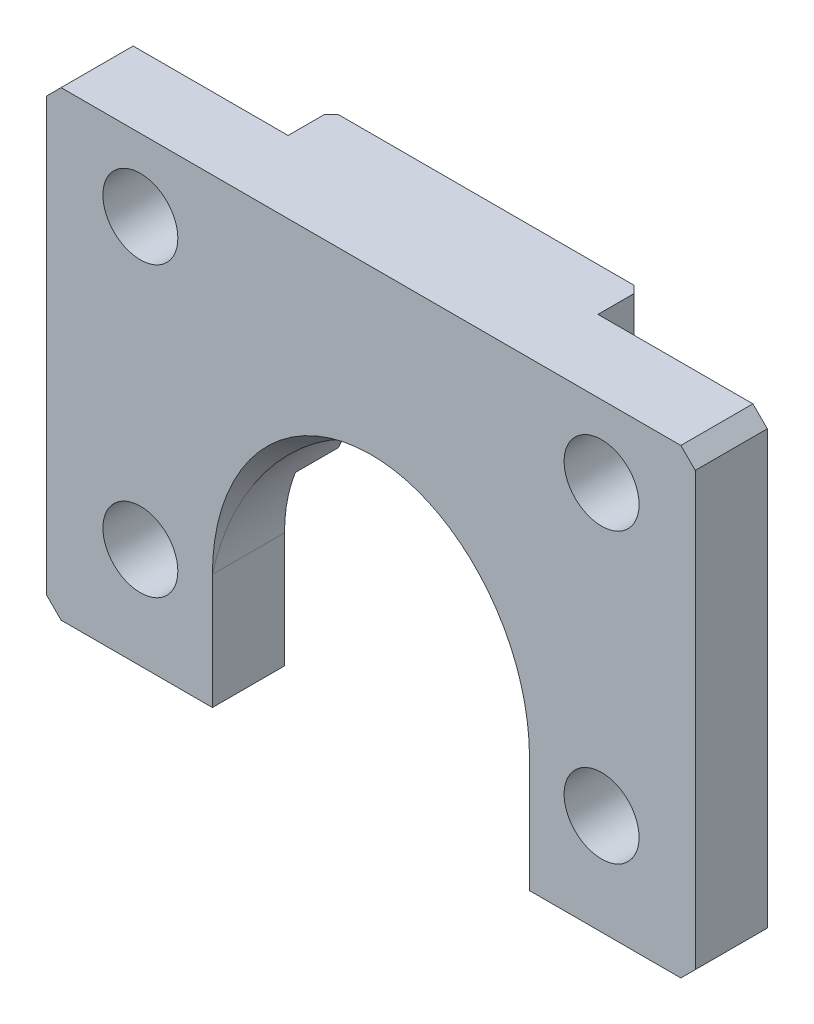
ISO-10303-21;
HEADER;
FILE_DESCRIPTION(('STEP AP214'),'2;1');
FILE_NAME('part.step','',(''),(''),'','','');
FILE_SCHEMA(('AUTOMOTIVE_DESIGN { 1 0 10303 214 1 1 1 1 }'));
ENDSEC;
DATA;
#1=APPLICATION_CONTEXT('core data for automotive mechanical design processes');
#2=APPLICATION_PROTOCOL_DEFINITION('international standard','automotive_design',2000,#1);
#3=PRODUCT_CONTEXT('',#1,'mechanical');
#4=PRODUCT('Part','Part','',(#3));
#5=PRODUCT_RELATED_PRODUCT_CATEGORY('part','',(#4));
#6=PRODUCT_DEFINITION_FORMATION('','',#4);
#7=PRODUCT_DEFINITION_CONTEXT('part definition',#1,'design');
#8=PRODUCT_DEFINITION('design','',#6,#7);
#9=PRODUCT_DEFINITION_SHAPE('','',#8);
#10=(LENGTH_UNIT() NAMED_UNIT(*) SI_UNIT(.MILLI.,.METRE.));
#11=(NAMED_UNIT(*) PLANE_ANGLE_UNIT() SI_UNIT($,.RADIAN.));
#12=(NAMED_UNIT(*) SI_UNIT($,.STERADIAN.) SOLID_ANGLE_UNIT());
#13=UNCERTAINTY_MEASURE_WITH_UNIT(LENGTH_MEASURE(1.E-05),#10,'distance_accuracy_value','');
#14=(GEOMETRIC_REPRESENTATION_CONTEXT(3) GLOBAL_UNCERTAINTY_ASSIGNED_CONTEXT((#13)) GLOBAL_UNIT_ASSIGNED_CONTEXT((#10,
#11,#12)) REPRESENTATION_CONTEXT('',''));
#15=CARTESIAN_POINT('',(0.,0.,0.));
#16=DIRECTION('',(0.,0.,1.));
#17=DIRECTION('',(1.,0.,0.));
#18=AXIS2_PLACEMENT_3D('',#15,#16,#17);
#19=CARTESIAN_POINT('',(-10.25,0.,-8.));
#20=DIRECTION('',(-0.707106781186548,0.,-0.707106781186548));
#21=DIRECTION('',(-0.707106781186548,0.,0.707106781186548));
#22=AXIS2_PLACEMENT_3D('',#19,#20,#21);
#23=PLANE('',#22);
#24=DIRECTION('',(-0.707106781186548,0.,0.707106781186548));
#25=VECTOR('',#24,1.);
#26=CARTESIAN_POINT('',(-10.25,0.,-8.));
#27=LINE('',#26,#25);
#28=CARTESIAN_POINT('',(-10.75,0.,-7.5));
#29=VERTEX_POINT('',#28);
#30=CARTESIAN_POINT('',(-10.25,0.,-8.));
#31=VERTEX_POINT('',#30);
#32=EDGE_CURVE('E229',#29,#31,#27,.F.);
#33=ORIENTED_EDGE('',*,*,#32,.T.);
#34=DIRECTION('',(0.,1.,0.));
#35=VECTOR('',#34,1.);
#36=CARTESIAN_POINT('',(-10.25,0.,-8.));
#37=LINE('',#36,#35);
#38=CARTESIAN_POINT('',(-10.2492074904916,-20.0027399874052,-8.00012340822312));
#39=VERTEX_POINT('',#38);
#40=EDGE_CURVE('E194',#39,#31,#37,.T.);
#41=ORIENTED_EDGE('',*,*,#40,.F.);
#42=DIRECTION('',(-0.707106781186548,0.,0.707106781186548));
#43=VECTOR('',#42,1.);
#44=CARTESIAN_POINT('',(-10.25,-20.,-8.));
#45=LINE('',#44,#43);
#46=CARTESIAN_POINT('',(-10.75,-20.,-7.5));
#47=VERTEX_POINT('',#46);
#48=EDGE_CURVE('E75',#39,#47,#45,.T.);
#49=ORIENTED_EDGE('',*,*,#48,.T.);
#50=DIRECTION('',(0.,1.,0.));
#51=VECTOR('',#50,1.);
#52=CARTESIAN_POINT('',(-10.75,0.,-7.5));
#53=LINE('',#52,#51);
#54=EDGE_CURVE('E113',#29,#47,#53,.F.);
#55=ORIENTED_EDGE('',*,*,#54,.F.);
#56=EDGE_LOOP('',(#33,#41,#49,#55));
#57=FACE_BOUND('',#56,.T.);
#58=ADVANCED_FACE('F16',(#57),#23,.T.);
#59=CARTESIAN_POINT('',(10.75,0.,-7.5));
#60=DIRECTION('',(0.707106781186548,0.,-0.707106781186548));
#61=DIRECTION('',(-0.707106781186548,0.,-0.707106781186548));
#62=AXIS2_PLACEMENT_3D('',#59,#60,#61);
#63=PLANE('',#62);
#64=DIRECTION('',(-0.707106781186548,0.,-0.707106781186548));
#65=VECTOR('',#64,1.);
#66=CARTESIAN_POINT('',(10.75,0.,-7.5));
#67=LINE('',#66,#65);
#68=CARTESIAN_POINT('',(10.25,0.,-8.));
#69=VERTEX_POINT('',#68);
#70=CARTESIAN_POINT('',(10.75,0.,-7.5));
#71=VERTEX_POINT('',#70);
#72=EDGE_CURVE('E91',#69,#71,#67,.F.);
#73=ORIENTED_EDGE('',*,*,#72,.T.);
#74=DIRECTION('',(0.,1.,0.));
#75=VECTOR('',#74,1.);
#76=CARTESIAN_POINT('',(10.75,0.,-7.5));
#77=LINE('',#76,#75);
#78=CARTESIAN_POINT('',(10.75,-20.,-7.5));
#79=VERTEX_POINT('',#78);
#80=EDGE_CURVE('E84',#79,#71,#77,.T.);
#81=ORIENTED_EDGE('',*,*,#80,.F.);
#82=DIRECTION('',(-0.707106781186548,0.,-0.707106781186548));
#83=VECTOR('',#82,1.);
#84=CARTESIAN_POINT('',(10.75,-20.,-7.5));
#85=LINE('',#84,#83);
#86=CARTESIAN_POINT('',(10.2492074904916,-20.0027399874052,-8.00012340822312));
#87=VERTEX_POINT('',#86);
#88=EDGE_CURVE('E88',#79,#87,#85,.T.);
#89=ORIENTED_EDGE('',*,*,#88,.T.);
#90=DIRECTION('',(0.,-1.,0.));
#91=VECTOR('',#90,1.);
#92=CARTESIAN_POINT('',(10.25,0.,-8.));
#93=LINE('',#92,#91);
#94=EDGE_CURVE('E191',#69,#87,#93,.T.);
#95=ORIENTED_EDGE('',*,*,#94,.F.);
#96=EDGE_LOOP('',(#73,#81,#89,#95));
#97=FACE_BOUND('',#96,.T.);
#98=ADVANCED_FACE('F86',(#97),#63,.T.);
#99=CARTESIAN_POINT('',(27.,-20.,-8.));
#100=DIRECTION('',(0.,1.,0.));
#101=DIRECTION('',(0.,0.,1.));
#102=AXIS2_PLACEMENT_3D('',#99,#100,#101);
#103=PLANE('',#102);
#104=DIRECTION('',(0.,0.,-1.));
#105=VECTOR('',#104,1.);
#106=CARTESIAN_POINT('',(10.75,-20.,-8.));
#107=LINE('',#106,#105);
#108=CARTESIAN_POINT('',(10.75,-20.,-5.));
#109=VERTEX_POINT('',#108);
#110=EDGE_CURVE('E96',#109,#79,#107,.T.);
#111=ORIENTED_EDGE('',*,*,#110,.F.);
#112=DIRECTION('',(1.,0.,0.));
#113=VECTOR('',#112,1.);
#114=CARTESIAN_POINT('',(27.,-20.,-5.));
#115=LINE('',#114,#113);
#116=CARTESIAN_POINT('',(10.2469507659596,-20.,-5.));
#117=VERTEX_POINT('',#116);
#118=EDGE_CURVE('E106',#117,#109,#115,.T.);
#119=ORIENTED_EDGE('',*,*,#118,.F.);
#120=DIRECTION('',(0.,0.,1.));
#121=VECTOR('',#120,1.);
#122=CARTESIAN_POINT('',(10.2469507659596,-20.,-5.));
#123=LINE('',#122,#121);
#124=EDGE_CURVE('E104',#117,#87,#123,.F.);
#125=ORIENTED_EDGE('',*,*,#124,.T.);
#126=ORIENTED_EDGE('',*,*,#88,.F.);
#127=EDGE_LOOP('',(#111,#119,#125,#126));
#128=FACE_BOUND('',#127,.T.);
#129=ADVANCED_FACE('F101',(#128),#103,.F.);
#130=CARTESIAN_POINT('',(27.,-20.,-8.));
#131=DIRECTION('',(0.,1.,0.));
#132=DIRECTION('',(0.,0.,1.));
#133=AXIS2_PLACEMENT_3D('',#130,#131,#132);
#134=PLANE('',#133);
#135=DIRECTION('',(0.,0.,1.));
#136=VECTOR('',#135,1.);
#137=CARTESIAN_POINT('',(-10.75,-20.,-5.));
#138=LINE('',#137,#136);
#139=CARTESIAN_POINT('',(-10.75,-20.,-5.));
#140=VERTEX_POINT('',#139);
#141=EDGE_CURVE('E199',#47,#140,#138,.T.);
#142=ORIENTED_EDGE('',*,*,#141,.F.);
#143=ORIENTED_EDGE('',*,*,#48,.F.);
#144=DIRECTION('',(0.,0.,1.));
#145=VECTOR('',#144,1.);
#146=CARTESIAN_POINT('',(-10.2469507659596,-20.,-8.00012340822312));
#147=LINE('',#146,#145);
#148=CARTESIAN_POINT('',(-10.2469507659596,-20.,-5.));
#149=VERTEX_POINT('',#148);
#150=EDGE_CURVE('E176',#39,#149,#147,.T.);
#151=ORIENTED_EDGE('',*,*,#150,.T.);
#152=DIRECTION('',(1.,0.,0.));
#153=VECTOR('',#152,1.);
#154=CARTESIAN_POINT('',(27.,-20.,-5.));
#155=LINE('',#154,#153);
#156=EDGE_CURVE('E203',#140,#149,#155,.T.);
#157=ORIENTED_EDGE('',*,*,#156,.F.);
#158=EDGE_LOOP('',(#142,#143,#151,#157));
#159=FACE_BOUND('',#158,.T.);
#160=ADVANCED_FACE('F311',(#159),#134,.F.);
#161=CARTESIAN_POINT('',(21.5,-32.,-5.));
#162=DIRECTION('',(-0.707106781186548,0.707106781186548,0.));
#163=DIRECTION('',(-0.707106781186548,-0.707106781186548,0.));
#164=AXIS2_PLACEMENT_3D('',#161,#162,#163);
#165=PLANE('',#164);
#166=DIRECTION('',(0.,0.,-1.));
#167=VECTOR('',#166,1.);
#168=CARTESIAN_POINT('',(22.5,-31.,-5.));
#169=LINE('',#168,#167);
#170=CARTESIAN_POINT('',(22.5,-31.,0.));
#171=VERTEX_POINT('',#170);
#172=CARTESIAN_POINT('',(22.5,-31.,-5.));
#173=VERTEX_POINT('',#172);
#174=EDGE_CURVE('E360',#171,#173,#169,.T.);
#175=ORIENTED_EDGE('',*,*,#174,.F.);
#176=DIRECTION('',(-0.707106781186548,-0.707106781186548,0.));
#177=VECTOR('',#176,1.);
#178=CARTESIAN_POINT('',(21.5,-32.,0.));
#179=LINE('',#178,#177);
#180=CARTESIAN_POINT('',(21.5,-32.,0.));
#181=VERTEX_POINT('',#180);
#182=EDGE_CURVE('E97',#181,#171,#179,.F.);
#183=ORIENTED_EDGE('',*,*,#182,.F.);
#184=DIRECTION('',(0.,0.,-1.));
#185=VECTOR('',#184,1.);
#186=CARTESIAN_POINT('',(21.5,-32.,0.));
#187=LINE('',#186,#185);
#188=CARTESIAN_POINT('',(21.5,-32.,-5.));
#189=VERTEX_POINT('',#188);
#190=EDGE_CURVE('E346',#189,#181,#187,.F.);
#191=ORIENTED_EDGE('',*,*,#190,.F.);
#192=DIRECTION('',(-0.707106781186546,-0.707106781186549,0.));
#193=VECTOR('',#192,1.);
#194=CARTESIAN_POINT('',(22.5,-31.,-5.));
#195=LINE('',#194,#193);
#196=EDGE_CURVE('E172',#173,#189,#195,.T.);
#197=ORIENTED_EDGE('',*,*,#196,.F.);
#198=EDGE_LOOP('',(#175,#183,#191,#197));
#199=FACE_BOUND('',#198,.T.);
#200=ADVANCED_FACE('F433',(#199),#165,.F.);
#201=CARTESIAN_POINT('',(10.75,0.,-8.));
#202=DIRECTION('',(1.,0.,0.));
#203=DIRECTION('',(0.,0.,-1.));
#204=AXIS2_PLACEMENT_3D('',#201,#202,#203);
#205=PLANE('',#204);
#206=DIRECTION('',(0.,1.,0.));
#207=VECTOR('',#206,1.);
#208=CARTESIAN_POINT('',(10.75,0.,-5.));
#209=LINE('',#208,#207);
#210=CARTESIAN_POINT('',(10.75,0.,-5.));
#211=VERTEX_POINT('',#210);
#212=EDGE_CURVE('E109',#109,#211,#209,.T.);
#213=ORIENTED_EDGE('',*,*,#212,.F.);
#214=ORIENTED_EDGE('',*,*,#110,.T.);
#215=ORIENTED_EDGE('',*,*,#80,.T.);
#216=DIRECTION('',(0.,0.,-1.));
#217=VECTOR('',#216,1.);
#218=CARTESIAN_POINT('',(10.75,0.,0.));
#219=LINE('',#218,#217);
#220=EDGE_CURVE('E125',#71,#211,#219,.F.);
#221=ORIENTED_EDGE('',*,*,#220,.T.);
#222=EDGE_LOOP('',(#213,#214,#215,#221));
#223=FACE_BOUND('',#222,.T.);
#224=ADVANCED_FACE('F107',(#223),#205,.T.);
#225=CARTESIAN_POINT('',(21.5,0.,-5.));
#226=DIRECTION('',(0.707106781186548,0.707106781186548,0.));
#227=DIRECTION('',(-0.707106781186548,0.707106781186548,0.));
#228=AXIS2_PLACEMENT_3D('',#225,#226,#227);
#229=PLANE('',#228);
#230=DIRECTION('',(0.707106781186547,-0.707106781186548,0.));
#231=VECTOR('',#230,1.);
#232=CARTESIAN_POINT('',(21.5,0.,-5.));
#233=LINE('',#232,#231);
#234=CARTESIAN_POINT('',(21.5,0.,-5.));
#235=VERTEX_POINT('',#234);
#236=CARTESIAN_POINT('',(22.5,-1.,-5.));
#237=VERTEX_POINT('',#236);
#238=EDGE_CURVE('E121',#235,#237,#233,.T.);
#239=ORIENTED_EDGE('',*,*,#238,.F.);
#240=DIRECTION('',(0.,0.,-1.));
#241=VECTOR('',#240,1.);
#242=CARTESIAN_POINT('',(21.5,0.,0.));
#243=LINE('',#242,#241);
#244=CARTESIAN_POINT('',(21.5,0.,0.));
#245=VERTEX_POINT('',#244);
#246=EDGE_CURVE('E405',#235,#245,#243,.F.);
#247=ORIENTED_EDGE('',*,*,#246,.T.);
#248=DIRECTION('',(-0.707106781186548,0.707106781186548,0.));
#249=VECTOR('',#248,1.);
#250=CARTESIAN_POINT('',(21.5,0.,0.));
#251=LINE('',#250,#249);
#252=CARTESIAN_POINT('',(22.5,-0.999999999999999,0.));
#253=VERTEX_POINT('',#252);
#254=EDGE_CURVE('E110',#245,#253,#251,.F.);
#255=ORIENTED_EDGE('',*,*,#254,.T.);
#256=DIRECTION('',(0.,0.,-1.));
#257=VECTOR('',#256,1.);
#258=CARTESIAN_POINT('',(22.5,-1.,-5.));
#259=LINE('',#258,#257);
#260=EDGE_CURVE('E128',#237,#253,#259,.F.);
#261=ORIENTED_EDGE('',*,*,#260,.F.);
#262=EDGE_LOOP('',(#239,#247,#255,#261));
#263=FACE_BOUND('',#262,.T.);
#264=ADVANCED_FACE('F469',(#263),#229,.T.);
#265=CARTESIAN_POINT('',(-10.75,0.,-5.));
#266=DIRECTION('',(-1.,0.,0.));
#267=DIRECTION('',(0.,0.,1.));
#268=AXIS2_PLACEMENT_3D('',#265,#266,#267);
#269=PLANE('',#268);
#270=ORIENTED_EDGE('',*,*,#54,.T.);
#271=ORIENTED_EDGE('',*,*,#141,.T.);
#272=DIRECTION('',(0.,1.,0.));
#273=VECTOR('',#272,1.);
#274=CARTESIAN_POINT('',(-10.75,0.,-5.));
#275=LINE('',#274,#273);
#276=CARTESIAN_POINT('',(-10.75,0.,-5.));
#277=VERTEX_POINT('',#276);
#278=EDGE_CURVE('E175',#277,#140,#275,.F.);
#279=ORIENTED_EDGE('',*,*,#278,.F.);
#280=DIRECTION('',(0.,0.,-1.));
#281=VECTOR('',#280,1.);
#282=CARTESIAN_POINT('',(-10.75,0.,0.));
#283=LINE('',#282,#281);
#284=EDGE_CURVE('E131',#277,#29,#283,.T.);
#285=ORIENTED_EDGE('',*,*,#284,.T.);
#286=EDGE_LOOP('',(#270,#271,#279,#285));
#287=FACE_BOUND('',#286,.T.);
#288=ADVANCED_FACE('F250',(#287),#269,.T.);
#289=CARTESIAN_POINT('',(-10.75,0.,-8.));
#290=DIRECTION('',(0.,0.,-1.));
#291=DIRECTION('',(-1.,0.,0.));
#292=AXIS2_PLACEMENT_3D('',#289,#290,#291);
#293=PLANE('',#292);
#294=ORIENTED_EDGE('',*,*,#94,.T.);
#295=CARTESIAN_POINT('',(0.,-24.,-8.));
#296=DIRECTION('',(0.,0.,1.));
#297=DIRECTION('',(1.,0.,0.));
#298=AXIS2_PLACEMENT_3D('',#295,#296,#297);
#299=CIRCLE('',#298,11.);
#300=EDGE_CURVE('E180',#87,#39,#299,.T.);
#301=ORIENTED_EDGE('',*,*,#300,.T.);
#302=ORIENTED_EDGE('',*,*,#40,.T.);
#303=DIRECTION('',(1.,0.,0.));
#304=VECTOR('',#303,1.);
#305=CARTESIAN_POINT('',(0.,0.,-8.));
#306=LINE('',#305,#304);
#307=EDGE_CURVE('E134',#31,#69,#306,.T.);
#308=ORIENTED_EDGE('',*,*,#307,.T.);
#309=EDGE_LOOP('',(#294,#301,#302,#308));
#310=FACE_BOUND('',#309,.T.);
#311=ADVANCED_FACE('F309',(#310),#293,.T.);
#312=CARTESIAN_POINT('',(-21.5,0.,0.));
#313=DIRECTION('',(-0.707106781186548,0.707106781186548,0.));
#314=DIRECTION('',(-0.707106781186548,-0.707106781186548,0.));
#315=AXIS2_PLACEMENT_3D('',#312,#313,#314);
#316=PLANE('',#315);
#317=DIRECTION('',(-0.707106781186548,-0.707106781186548,0.));
#318=VECTOR('',#317,1.);
#319=CARTESIAN_POINT('',(-21.5,0.,0.));
#320=LINE('',#319,#318);
#321=CARTESIAN_POINT('',(-22.5,-0.999999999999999,0.));
#322=VERTEX_POINT('',#321);
#323=CARTESIAN_POINT('',(-21.5,0.,0.));
#324=VERTEX_POINT('',#323);
#325=EDGE_CURVE('E193',#322,#324,#320,.F.);
#326=ORIENTED_EDGE('',*,*,#325,.T.);
#327=DIRECTION('',(0.,0.,-1.));
#328=VECTOR('',#327,1.);
#329=CARTESIAN_POINT('',(-21.5,0.,0.));
#330=LINE('',#329,#328);
#331=CARTESIAN_POINT('',(-21.5,0.,-5.));
#332=VERTEX_POINT('',#331);
#333=EDGE_CURVE('E386',#324,#332,#330,.T.);
#334=ORIENTED_EDGE('',*,*,#333,.T.);
#335=DIRECTION('',(0.707106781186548,0.707106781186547,0.));
#336=VECTOR('',#335,1.);
#337=CARTESIAN_POINT('',(-22.5,-1.,-5.));
#338=LINE('',#337,#336);
#339=CARTESIAN_POINT('',(-22.5,-1.,-5.));
#340=VERTEX_POINT('',#339);
#341=EDGE_CURVE('E243',#340,#332,#338,.T.);
#342=ORIENTED_EDGE('',*,*,#341,.F.);
#343=DIRECTION('',(0.,0.,1.));
#344=VECTOR('',#343,1.);
#345=CARTESIAN_POINT('',(-22.5,-1.,0.));
#346=LINE('',#345,#344);
#347=EDGE_CURVE('E370',#322,#340,#346,.F.);
#348=ORIENTED_EDGE('',*,*,#347,.F.);
#349=EDGE_LOOP('',(#326,#334,#342,#348));
#350=FACE_BOUND('',#349,.T.);
#351=ADVANCED_FACE('F384',(#350),#316,.T.);
#352=CARTESIAN_POINT('',(-21.5,-32.,0.));
#353=DIRECTION('',(0.707106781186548,0.707106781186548,0.));
#354=DIRECTION('',(-0.707106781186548,0.707106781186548,0.));
#355=AXIS2_PLACEMENT_3D('',#352,#353,#354);
#356=PLANE('',#355);
#357=DIRECTION('',(0.,0.,1.));
#358=VECTOR('',#357,1.);
#359=CARTESIAN_POINT('',(-22.5,-31.,0.));
#360=LINE('',#359,#358);
#361=CARTESIAN_POINT('',(-22.5,-31.,-5.));
#362=VERTEX_POINT('',#361);
#363=CARTESIAN_POINT('',(-22.5,-31.,0.));
#364=VERTEX_POINT('',#363);
#365=EDGE_CURVE('E367',#362,#364,#360,.T.);
#366=ORIENTED_EDGE('',*,*,#365,.F.);
#367=DIRECTION('',(-0.707106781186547,0.707106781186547,0.));
#368=VECTOR('',#367,1.);
#369=CARTESIAN_POINT('',(-21.5,-32.,-5.));
#370=LINE('',#369,#368);
#371=CARTESIAN_POINT('',(-21.5,-32.,-5.));
#372=VERTEX_POINT('',#371);
#373=EDGE_CURVE('E179',#372,#362,#370,.T.);
#374=ORIENTED_EDGE('',*,*,#373,.F.);
#375=DIRECTION('',(0.,0.,-1.));
#376=VECTOR('',#375,1.);
#377=CARTESIAN_POINT('',(-21.5,-32.,0.));
#378=LINE('',#377,#376);
#379=CARTESIAN_POINT('',(-21.5,-32.,0.));
#380=VERTEX_POINT('',#379);
#381=EDGE_CURVE('E390',#380,#372,#378,.T.);
#382=ORIENTED_EDGE('',*,*,#381,.F.);
#383=DIRECTION('',(-0.707106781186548,0.707106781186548,0.));
#384=VECTOR('',#383,1.);
#385=CARTESIAN_POINT('',(-21.5,-32.,0.));
#386=LINE('',#385,#384);
#387=EDGE_CURVE('E188',#364,#380,#386,.F.);
#388=ORIENTED_EDGE('',*,*,#387,.F.);
#389=EDGE_LOOP('',(#366,#374,#382,#388));
#390=FACE_BOUND('',#389,.T.);
#391=ADVANCED_FACE('F529',(#390),#356,.F.);
#392=CARTESIAN_POINT('',(0.,-24.,0.));
#393=DIRECTION('',(0.,0.,1.));
#394=DIRECTION('',(1.,0.,0.));
#395=AXIS2_PLACEMENT_3D('',#392,#393,#394);
#396=CYLINDRICAL_SURFACE('',#395,11.);
#397=CARTESIAN_POINT('',(0.,-24.,-5.));
#398=DIRECTION('',(0.,0.,1.));
#399=DIRECTION('',(1.,0.,0.));
#400=AXIS2_PLACEMENT_3D('',#397,#398,#399);
#401=CIRCLE('',#400,11.);
#402=CARTESIAN_POINT('',(-11.,-24.,-5.));
#403=VERTEX_POINT('',#402);
#404=EDGE_CURVE('E122',#149,#403,#401,.T.);
#405=ORIENTED_EDGE('',*,*,#404,.F.);
#406=ORIENTED_EDGE('',*,*,#150,.F.);
#407=ORIENTED_EDGE('',*,*,#300,.F.);
#408=ORIENTED_EDGE('',*,*,#124,.F.);
#409=CARTESIAN_POINT('',(0.,-24.,-5.));
#410=DIRECTION('',(0.,0.,1.));
#411=DIRECTION('',(1.,0.,0.));
#412=AXIS2_PLACEMENT_3D('',#409,#410,#411);
#413=CIRCLE('',#412,11.);
#414=CARTESIAN_POINT('',(11.,-24.,-5.));
#415=VERTEX_POINT('',#414);
#416=EDGE_CURVE('E169',#415,#117,#413,.T.);
#417=ORIENTED_EDGE('',*,*,#416,.F.);
#418=DIRECTION('',(0.,0.,-1.));
#419=VECTOR('',#418,1.);
#420=CARTESIAN_POINT('',(11.,-24.,0.));
#421=LINE('',#420,#419);
#422=CARTESIAN_POINT('',(11.,-24.0000000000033,0.));
#423=VERTEX_POINT('',#422);
#424=EDGE_CURVE('E165',#415,#423,#421,.F.);
#425=ORIENTED_EDGE('',*,*,#424,.T.);
#426=CARTESIAN_POINT('',(0.,-24.,-2.06779038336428E-12));
#427=DIRECTION('',(0.,0.25881904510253,0.965925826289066));
#428=DIRECTION('',(0.,-0.965925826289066,0.25881904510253));
#429=AXIS2_PLACEMENT_3D('',#426,#427,#428);
#430=ELLIPSE('',#429,11.3880379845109,11.);
#431=CARTESIAN_POINT('',(-11.,-24.0000000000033,0.));
#432=VERTEX_POINT('',#431);
#433=EDGE_CURVE('E34',#423,#432,#430,.T.);
#434=ORIENTED_EDGE('',*,*,#433,.T.);
#435=DIRECTION('',(0.,0.,1.));
#436=VECTOR('',#435,1.);
#437=CARTESIAN_POINT('',(-11.,-24.,0.));
#438=LINE('',#437,#436);
#439=EDGE_CURVE('E312',#432,#403,#438,.F.);
#440=ORIENTED_EDGE('',*,*,#439,.T.);
#441=EDGE_LOOP('',(#405,#406,#407,#408,#417,#425,#434,#440));
#442=FACE_BOUND('',#441,.T.);
#443=ADVANCED_FACE('F306',(#442),#396,.F.);
#444=CARTESIAN_POINT('',(10.75,0.,-5.));
#445=DIRECTION('',(0.,0.,-1.));
#446=DIRECTION('',(-1.,0.,0.));
#447=AXIS2_PLACEMENT_3D('',#444,#445,#446);
#448=PLANE('',#447);
#449=CARTESIAN_POINT('',(-16.,-25.,-5.));
#450=DIRECTION('',(0.,0.,1.));
#451=DIRECTION('',(1.,0.,0.));
#452=AXIS2_PLACEMENT_3D('',#449,#450,#451);
#453=CIRCLE('',#452,2.6);
#454=CARTESIAN_POINT('',(-13.4,-25.,-5.));
#455=VERTEX_POINT('',#454);
#456=EDGE_CURVE('E157',#455,#455,#453,.T.);
#457=ORIENTED_EDGE('',*,*,#456,.T.);
#458=EDGE_LOOP('',(#457));
#459=FACE_BOUND('',#458,.T.);
#460=CARTESIAN_POINT('',(-16.,-5.,-5.));
#461=DIRECTION('',(0.,0.,1.));
#462=DIRECTION('',(1.,0.,0.));
#463=AXIS2_PLACEMENT_3D('',#460,#461,#462);
#464=CIRCLE('',#463,2.6);
#465=CARTESIAN_POINT('',(-13.4,-5.,-5.));
#466=VERTEX_POINT('',#465);
#467=EDGE_CURVE('E160',#466,#466,#464,.T.);
#468=ORIENTED_EDGE('',*,*,#467,.T.);
#469=EDGE_LOOP('',(#468));
#470=FACE_BOUND('',#469,.T.);
#471=ORIENTED_EDGE('',*,*,#156,.T.);
#472=ORIENTED_EDGE('',*,*,#404,.T.);
#473=DIRECTION('',(0.,1.,0.));
#474=VECTOR('',#473,1.);
#475=CARTESIAN_POINT('',(-11.,-24.,-5.));
#476=LINE('',#475,#474);
#477=CARTESIAN_POINT('',(-11.,-32.,-5.));
#478=VERTEX_POINT('',#477);
#479=EDGE_CURVE('E316',#403,#478,#476,.F.);
#480=ORIENTED_EDGE('',*,*,#479,.T.);
#481=DIRECTION('',(1.,0.,0.));
#482=VECTOR('',#481,1.);
#483=CARTESIAN_POINT('',(0.,-32.,-5.));
#484=LINE('',#483,#482);
#485=EDGE_CURVE('E325',#372,#478,#484,.T.);
#486=ORIENTED_EDGE('',*,*,#485,.F.);
#487=ORIENTED_EDGE('',*,*,#373,.T.);
#488=DIRECTION('',(0.,1.,0.));
#489=VECTOR('',#488,1.);
#490=CARTESIAN_POINT('',(-22.5,0.,-5.));
#491=LINE('',#490,#489);
#492=EDGE_CURVE('E234',#340,#362,#491,.F.);
#493=ORIENTED_EDGE('',*,*,#492,.F.);
#494=ORIENTED_EDGE('',*,*,#341,.T.);
#495=DIRECTION('',(1.,0.,0.));
#496=VECTOR('',#495,1.);
#497=CARTESIAN_POINT('',(0.,0.,-5.));
#498=LINE('',#497,#496);
#499=EDGE_CURVE('E135',#332,#277,#498,.T.);
#500=ORIENTED_EDGE('',*,*,#499,.T.);
#501=ORIENTED_EDGE('',*,*,#278,.T.);
#502=EDGE_LOOP('',(#471,#472,#480,#486,#487,#493,#494,#500,#501));
#503=FACE_BOUND('',#502,.T.);
#504=ADVANCED_FACE('F314',(#459,#470,#503),#448,.T.);
#505=CARTESIAN_POINT('',(10.75,0.,-5.));
#506=DIRECTION('',(0.,0.,-1.));
#507=DIRECTION('',(-1.,0.,0.));
#508=AXIS2_PLACEMENT_3D('',#505,#506,#507);
#509=PLANE('',#508);
#510=CARTESIAN_POINT('',(16.,-25.,-5.));
#511=DIRECTION('',(0.,0.,1.));
#512=DIRECTION('',(1.,0.,0.));
#513=AXIS2_PLACEMENT_3D('',#510,#511,#512);
#514=CIRCLE('',#513,2.6);
#515=CARTESIAN_POINT('',(18.6,-25.,-5.));
#516=VERTEX_POINT('',#515);
#517=EDGE_CURVE('E150',#516,#516,#514,.T.);
#518=ORIENTED_EDGE('',*,*,#517,.T.);
#519=EDGE_LOOP('',(#518));
#520=FACE_BOUND('',#519,.T.);
#521=CARTESIAN_POINT('',(16.,-5.,-5.));
#522=DIRECTION('',(0.,0.,1.));
#523=DIRECTION('',(1.,0.,0.));
#524=AXIS2_PLACEMENT_3D('',#521,#522,#523);
#525=CIRCLE('',#524,2.6);
#526=CARTESIAN_POINT('',(18.6,-5.,-5.));
#527=VERTEX_POINT('',#526);
#528=EDGE_CURVE('E154',#527,#527,#525,.T.);
#529=ORIENTED_EDGE('',*,*,#528,.T.);
#530=EDGE_LOOP('',(#529));
#531=FACE_BOUND('',#530,.T.);
#532=DIRECTION('',(0.,1.,0.));
#533=VECTOR('',#532,1.);
#534=CARTESIAN_POINT('',(11.,-32.,-5.));
#535=LINE('',#534,#533);
#536=CARTESIAN_POINT('',(11.,-32.,-5.));
#537=VERTEX_POINT('',#536);
#538=EDGE_CURVE('E168',#537,#415,#535,.T.);
#539=ORIENTED_EDGE('',*,*,#538,.T.);
#540=ORIENTED_EDGE('',*,*,#416,.T.);
#541=ORIENTED_EDGE('',*,*,#118,.T.);
#542=ORIENTED_EDGE('',*,*,#212,.T.);
#543=DIRECTION('',(1.,0.,0.));
#544=VECTOR('',#543,1.);
#545=CARTESIAN_POINT('',(0.,0.,-5.));
#546=LINE('',#545,#544);
#547=EDGE_CURVE('E127',#211,#235,#546,.T.);
#548=ORIENTED_EDGE('',*,*,#547,.T.);
#549=ORIENTED_EDGE('',*,*,#238,.T.);
#550=DIRECTION('',(0.,1.,0.));
#551=VECTOR('',#550,1.);
#552=CARTESIAN_POINT('',(22.5,0.,-5.));
#553=LINE('',#552,#551);
#554=EDGE_CURVE('E357',#173,#237,#553,.T.);
#555=ORIENTED_EDGE('',*,*,#554,.F.);
#556=ORIENTED_EDGE('',*,*,#196,.T.);
#557=DIRECTION('',(1.,0.,0.));
#558=VECTOR('',#557,1.);
#559=CARTESIAN_POINT('',(0.,-32.,-5.));
#560=LINE('',#559,#558);
#561=EDGE_CURVE('E167',#537,#189,#560,.T.);
#562=ORIENTED_EDGE('',*,*,#561,.F.);
#563=EDGE_LOOP('',(#539,#540,#541,#542,#548,#549,#555,#556,#562));
#564=FACE_BOUND('',#563,.T.);
#565=ADVANCED_FACE('F301',(#520,#531,#564),#509,.T.);
#566=CARTESIAN_POINT('',(11.,-32.,0.));
#567=DIRECTION('',(1.,0.,0.));
#568=DIRECTION('',(0.,0.,-1.));
#569=AXIS2_PLACEMENT_3D('',#566,#567,#568);
#570=PLANE('',#569);
#571=ORIENTED_EDGE('',*,*,#538,.F.);
#572=DIRECTION('',(0.,0.,-1.));
#573=VECTOR('',#572,1.);
#574=CARTESIAN_POINT('',(11.,-32.,0.));
#575=LINE('',#574,#573);
#576=CARTESIAN_POINT('',(11.,-32.,0.));
#577=VERTEX_POINT('',#576);
#578=EDGE_CURVE('E354',#577,#537,#575,.T.);
#579=ORIENTED_EDGE('',*,*,#578,.F.);
#580=DIRECTION('',(0.,1.,0.));
#581=VECTOR('',#580,1.);
#582=CARTESIAN_POINT('',(11.,0.,0.));
#583=LINE('',#582,#581);
#584=EDGE_CURVE('E153',#423,#577,#583,.F.);
#585=ORIENTED_EDGE('',*,*,#584,.F.);
#586=ORIENTED_EDGE('',*,*,#424,.F.);
#587=EDGE_LOOP('',(#571,#579,#585,#586));
#588=FACE_BOUND('',#587,.T.);
#589=ADVANCED_FACE('F426',(#588),#570,.F.);
#590=CARTESIAN_POINT('',(0.,-32.,0.));
#591=DIRECTION('',(0.,-1.,0.));
#592=DIRECTION('',(0.,0.,-1.));
#593=AXIS2_PLACEMENT_3D('',#590,#591,#592);
#594=PLANE('',#593);
#595=DIRECTION('',(1.,0.,0.));
#596=VECTOR('',#595,1.);
#597=CARTESIAN_POINT('',(22.5,-32.,0.));
#598=LINE('',#597,#596);
#599=EDGE_CURVE('E411',#577,#181,#598,.T.);
#600=ORIENTED_EDGE('',*,*,#599,.F.);
#601=ORIENTED_EDGE('',*,*,#578,.T.);
#602=ORIENTED_EDGE('',*,*,#561,.T.);
#603=ORIENTED_EDGE('',*,*,#190,.T.);
#604=EDGE_LOOP('',(#600,#601,#602,#603));
#605=FACE_BOUND('',#604,.T.);
#606=ADVANCED_FACE('F421',(#605),#594,.T.);
#607=CARTESIAN_POINT('',(22.5,0.,-5.));
#608=DIRECTION('',(1.,0.,0.));
#609=DIRECTION('',(0.,0.,-1.));
#610=AXIS2_PLACEMENT_3D('',#607,#608,#609);
#611=PLANE('',#610);
#612=ORIENTED_EDGE('',*,*,#554,.T.);
#613=ORIENTED_EDGE('',*,*,#260,.T.);
#614=DIRECTION('',(0.,1.,0.));
#615=VECTOR('',#614,1.);
#616=CARTESIAN_POINT('',(22.5,0.,0.));
#617=LINE('',#616,#615);
#618=EDGE_CURVE('E414',#171,#253,#617,.T.);
#619=ORIENTED_EDGE('',*,*,#618,.F.);
#620=ORIENTED_EDGE('',*,*,#174,.T.);
#621=EDGE_LOOP('',(#612,#613,#619,#620));
#622=FACE_BOUND('',#621,.T.);
#623=ADVANCED_FACE('F460',(#622),#611,.T.);
#624=CARTESIAN_POINT('',(0.,0.,0.));
#625=DIRECTION('',(0.,-1.,0.));
#626=DIRECTION('',(0.,0.,-1.));
#627=AXIS2_PLACEMENT_3D('',#624,#625,#626);
#628=PLANE('',#627);
#629=ORIENTED_EDGE('',*,*,#307,.F.);
#630=ORIENTED_EDGE('',*,*,#32,.F.);
#631=ORIENTED_EDGE('',*,*,#284,.F.);
#632=ORIENTED_EDGE('',*,*,#499,.F.);
#633=ORIENTED_EDGE('',*,*,#333,.F.);
#634=DIRECTION('',(1.,0.,0.));
#635=VECTOR('',#634,1.);
#636=CARTESIAN_POINT('',(22.5,0.,0.));
#637=LINE('',#636,#635);
#638=EDGE_CURVE('E225',#245,#324,#637,.F.);
#639=ORIENTED_EDGE('',*,*,#638,.F.);
#640=ORIENTED_EDGE('',*,*,#246,.F.);
#641=ORIENTED_EDGE('',*,*,#547,.F.);
#642=ORIENTED_EDGE('',*,*,#220,.F.);
#643=ORIENTED_EDGE('',*,*,#72,.F.);
#644=EDGE_LOOP('',(#629,#630,#631,#632,#633,#639,#640,#641,#642,#643));
#645=FACE_BOUND('',#644,.T.);
#646=ADVANCED_FACE('F466',(#645),#628,.F.);
#647=CARTESIAN_POINT('',(-22.5,0.,0.));
#648=DIRECTION('',(-1.,0.,0.));
#649=DIRECTION('',(0.,0.,1.));
#650=AXIS2_PLACEMENT_3D('',#647,#648,#649);
#651=PLANE('',#650);
#652=DIRECTION('',(0.,1.,0.));
#653=VECTOR('',#652,1.);
#654=CARTESIAN_POINT('',(-22.5,0.,0.));
#655=LINE('',#654,#653);
#656=EDGE_CURVE('E221',#322,#364,#655,.F.);
#657=ORIENTED_EDGE('',*,*,#656,.F.);
#658=ORIENTED_EDGE('',*,*,#347,.T.);
#659=ORIENTED_EDGE('',*,*,#492,.T.);
#660=ORIENTED_EDGE('',*,*,#365,.T.);
#661=EDGE_LOOP('',(#657,#658,#659,#660));
#662=FACE_BOUND('',#661,.T.);
#663=ADVANCED_FACE('F377',(#662),#651,.T.);
#664=CARTESIAN_POINT('',(0.,-32.,0.));
#665=DIRECTION('',(0.,-1.,0.));
#666=DIRECTION('',(0.,0.,-1.));
#667=AXIS2_PLACEMENT_3D('',#664,#665,#666);
#668=PLANE('',#667);
#669=ORIENTED_EDGE('',*,*,#485,.T.);
#670=DIRECTION('',(0.,0.,1.));
#671=VECTOR('',#670,1.);
#672=CARTESIAN_POINT('',(-11.,-32.,0.));
#673=LINE('',#672,#671);
#674=CARTESIAN_POINT('',(-11.,-32.,0.));
#675=VERTEX_POINT('',#674);
#676=EDGE_CURVE('E164',#478,#675,#673,.T.);
#677=ORIENTED_EDGE('',*,*,#676,.T.);
#678=DIRECTION('',(1.,0.,0.));
#679=VECTOR('',#678,1.);
#680=CARTESIAN_POINT('',(22.5,-32.,0.));
#681=LINE('',#680,#679);
#682=EDGE_CURVE('E224',#380,#675,#681,.T.);
#683=ORIENTED_EDGE('',*,*,#682,.F.);
#684=ORIENTED_EDGE('',*,*,#381,.T.);
#685=EDGE_LOOP('',(#669,#677,#683,#684));
#686=FACE_BOUND('',#685,.T.);
#687=ADVANCED_FACE('F508',(#686),#668,.T.);
#688=CARTESIAN_POINT('',(-11.,-24.,0.));
#689=DIRECTION('',(-1.,0.,0.));
#690=DIRECTION('',(0.,0.,1.));
#691=AXIS2_PLACEMENT_3D('',#688,#689,#690);
#692=PLANE('',#691);
#693=ORIENTED_EDGE('',*,*,#479,.F.);
#694=ORIENTED_EDGE('',*,*,#439,.F.);
#695=DIRECTION('',(0.,1.,0.));
#696=VECTOR('',#695,1.);
#697=CARTESIAN_POINT('',(-11.,0.,0.));
#698=LINE('',#697,#696);
#699=EDGE_CURVE('E149',#675,#432,#698,.T.);
#700=ORIENTED_EDGE('',*,*,#699,.F.);
#701=ORIENTED_EDGE('',*,*,#676,.F.);
#702=EDGE_LOOP('',(#693,#694,#700,#701));
#703=FACE_BOUND('',#702,.T.);
#704=ADVANCED_FACE('F320',(#703),#692,.F.);
#705=CARTESIAN_POINT('',(0.,-6.705273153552,29.95534560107));
#706=DIRECTION('',(0.,-0.500000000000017,-0.866025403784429));
#707=DIRECTION('',(0.,0.866025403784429,-0.500000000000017));
#708=AXIS2_PLACEMENT_3D('',#705,#706,#707);
#709=CYLINDRICAL_SURFACE('',#708,11.);
#710=CARTESIAN_POINT('',(0.,-23.9999999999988,0.));
#711=DIRECTION('',(0.,0.,1.));
#712=DIRECTION('',(0.,-1.,0.));
#713=AXIS2_PLACEMENT_3D('',#710,#711,#712);
#714=ELLIPSE('',#713,12.7017059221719,11.);
#715=EDGE_CURVE('E146',#432,#423,#714,.F.);
#716=ORIENTED_EDGE('',*,*,#715,.F.);
#717=ORIENTED_EDGE('',*,*,#433,.F.);
#718=EDGE_LOOP('',(#716,#717));
#719=FACE_BOUND('',#718,.T.);
#720=ADVANCED_FACE('F501',(#719),#709,.F.);
#721=CARTESIAN_POINT('',(-16.,-5.,0.));
#722=DIRECTION('',(0.,0.,1.));
#723=DIRECTION('',(1.,0.,0.));
#724=AXIS2_PLACEMENT_3D('',#721,#722,#723);
#725=CYLINDRICAL_SURFACE('',#724,2.6);
#726=ORIENTED_EDGE('',*,*,#467,.F.);
#727=EDGE_LOOP('',(#726));
#728=FACE_BOUND('',#727,.T.);
#729=CARTESIAN_POINT('',(-16.,-5.,0.));
#730=DIRECTION('',(0.,0.,1.));
#731=DIRECTION('',(1.,0.,0.));
#732=AXIS2_PLACEMENT_3D('',#729,#730,#731);
#733=CIRCLE('',#732,2.6);
#734=CARTESIAN_POINT('',(-13.4,-5.,0.));
#735=VERTEX_POINT('',#734);
#736=EDGE_CURVE('E143',#735,#735,#733,.F.);
#737=ORIENTED_EDGE('',*,*,#736,.F.);
#738=EDGE_LOOP('',(#737));
#739=FACE_BOUND('',#738,.T.);
#740=ADVANCED_FACE('F497',(#728,#739),#725,.F.);
#741=CARTESIAN_POINT('',(-16.,-25.,0.));
#742=DIRECTION('',(0.,0.,1.));
#743=DIRECTION('',(1.,0.,0.));
#744=AXIS2_PLACEMENT_3D('',#741,#742,#743);
#745=CYLINDRICAL_SURFACE('',#744,2.6);
#746=ORIENTED_EDGE('',*,*,#456,.F.);
#747=EDGE_LOOP('',(#746));
#748=FACE_BOUND('',#747,.T.);
#749=CARTESIAN_POINT('',(-16.,-25.,0.));
#750=DIRECTION('',(0.,0.,1.));
#751=DIRECTION('',(1.,0.,0.));
#752=AXIS2_PLACEMENT_3D('',#749,#750,#751);
#753=CIRCLE('',#752,2.6);
#754=CARTESIAN_POINT('',(-13.4,-25.,0.));
#755=VERTEX_POINT('',#754);
#756=EDGE_CURVE('E140',#755,#755,#753,.F.);
#757=ORIENTED_EDGE('',*,*,#756,.F.);
#758=EDGE_LOOP('',(#757));
#759=FACE_BOUND('',#758,.T.);
#760=ADVANCED_FACE('F493',(#748,#759),#745,.F.);
#761=CARTESIAN_POINT('',(16.,-5.,0.));
#762=DIRECTION('',(0.,0.,1.));
#763=DIRECTION('',(1.,0.,0.));
#764=AXIS2_PLACEMENT_3D('',#761,#762,#763);
#765=CYLINDRICAL_SURFACE('',#764,2.6);
#766=CARTESIAN_POINT('',(16.,-5.,0.));
#767=DIRECTION('',(0.,0.,1.));
#768=DIRECTION('',(1.,0.,0.));
#769=AXIS2_PLACEMENT_3D('',#766,#767,#768);
#770=CIRCLE('',#769,2.6);
#771=CARTESIAN_POINT('',(18.6,-5.,0.));
#772=VERTEX_POINT('',#771);
#773=EDGE_CURVE('E25',#772,#772,#770,.F.);
#774=ORIENTED_EDGE('',*,*,#773,.F.);
#775=EDGE_LOOP('',(#774));
#776=FACE_BOUND('',#775,.T.);
#777=ORIENTED_EDGE('',*,*,#528,.F.);
#778=EDGE_LOOP('',(#777));
#779=FACE_BOUND('',#778,.T.);
#780=ADVANCED_FACE('F486',(#776,#779),#765,.F.);
#781=CARTESIAN_POINT('',(16.,-25.,0.));
#782=DIRECTION('',(0.,0.,1.));
#783=DIRECTION('',(1.,0.,0.));
#784=AXIS2_PLACEMENT_3D('',#781,#782,#783);
#785=CYLINDRICAL_SURFACE('',#784,2.6);
#786=CARTESIAN_POINT('',(16.,-25.,0.));
#787=DIRECTION('',(0.,0.,1.));
#788=DIRECTION('',(1.,0.,0.));
#789=AXIS2_PLACEMENT_3D('',#786,#787,#788);
#790=CIRCLE('',#789,2.6);
#791=CARTESIAN_POINT('',(18.6,-25.,0.));
#792=VERTEX_POINT('',#791);
#793=EDGE_CURVE('E11',#792,#792,#790,.F.);
#794=ORIENTED_EDGE('',*,*,#793,.F.);
#795=EDGE_LOOP('',(#794));
#796=FACE_BOUND('',#795,.T.);
#797=ORIENTED_EDGE('',*,*,#517,.F.);
#798=EDGE_LOOP('',(#797));
#799=FACE_BOUND('',#798,.T.);
#800=ADVANCED_FACE('F480',(#796,#799),#785,.F.);
#801=CARTESIAN_POINT('',(22.5,0.,0.));
#802=DIRECTION('',(0.,0.,1.));
#803=DIRECTION('',(1.,0.,0.));
#804=AXIS2_PLACEMENT_3D('',#801,#802,#803);
#805=PLANE('',#804);
#806=ORIENTED_EDGE('',*,*,#793,.T.);
#807=EDGE_LOOP('',(#806));
#808=FACE_BOUND('',#807,.T.);
#809=ORIENTED_EDGE('',*,*,#773,.T.);
#810=EDGE_LOOP('',(#809));
#811=FACE_BOUND('',#810,.T.);
#812=ORIENTED_EDGE('',*,*,#756,.T.);
#813=EDGE_LOOP('',(#812));
#814=FACE_BOUND('',#813,.T.);
#815=ORIENTED_EDGE('',*,*,#736,.T.);
#816=EDGE_LOOP('',(#815));
#817=FACE_BOUND('',#816,.T.);
#818=ORIENTED_EDGE('',*,*,#699,.T.);
#819=ORIENTED_EDGE('',*,*,#715,.T.);
#820=ORIENTED_EDGE('',*,*,#584,.T.);
#821=ORIENTED_EDGE('',*,*,#599,.T.);
#822=ORIENTED_EDGE('',*,*,#182,.T.);
#823=ORIENTED_EDGE('',*,*,#618,.T.);
#824=ORIENTED_EDGE('',*,*,#254,.F.);
#825=ORIENTED_EDGE('',*,*,#638,.T.);
#826=ORIENTED_EDGE('',*,*,#325,.F.);
#827=ORIENTED_EDGE('',*,*,#656,.T.);
#828=ORIENTED_EDGE('',*,*,#387,.T.);
#829=ORIENTED_EDGE('',*,*,#682,.T.);
#830=EDGE_LOOP('',(#818,#819,#820,#821,#822,#823,#824,#825,#826,#827,#828,#829));
#831=FACE_BOUND('',#830,.T.);
#832=ADVANCED_FACE('F437',(#808,#811,#814,#817,#831),#805,.T.);
#833=CLOSED_SHELL('',(#58,#98,#129,#160,#200,#224,#264,#288,#311,#351,#391,#443,#504,#565,#589,
#606,#623,#646,#663,#687,#704,#720,#740,#760,#780,#800,#832));
#834=MANIFOLD_SOLID_BREP('B1',#833);
#835=ADVANCED_BREP_SHAPE_REPRESENTATION('',(#18,#834),#14);
#836=SHAPE_DEFINITION_REPRESENTATION(#9,#835);
ENDSEC;
END-ISO-10303-21;
